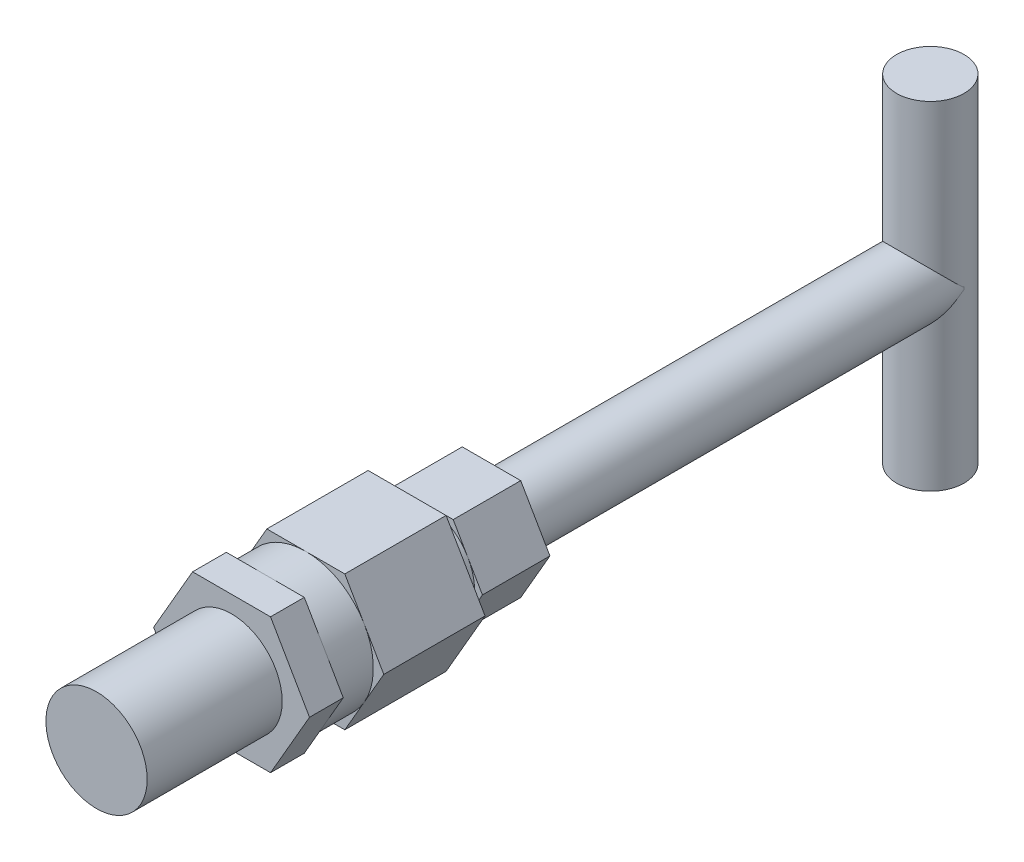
from build123d import *

# Parameters (mm, degrees)
BOSS_EXTRUDE1_DEPTH = 3
SKETCH2_R           = 4
BOSS_EXTRUDE2_DEPTH = 2.4
BOSS_EXTRUDE4_DEPTH = 2
SKETCH5_R           = 3
BOSS_EXTRUDE5_DEPTH = 8
BOSS_EXTRUDE6_START = 1
SKETCH3_R           = 3
BOSS_EXTRUDE6_DEPTH = 1
BOSS_EXTRUDE7_DEPTH = 4
SKETCH7_R           = 2
BOSS_EXTRUDE8_DEPTH = 26
SKETCH9_R           = 1.99809491
BOSS_EXTRUDE9_DEPTH = 10


with BuildPart() as part:
    # Sketch1 → Boss-Extrude1 (new, symmetric)
    with BuildSketch(Plane.XY):
        Polygon((2.309401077, 4), (-2.309401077, 4), (-4.618802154, 0), (-2.309401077, -4), (2.309401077, -4), (4.618802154, 0), align=None)
    extrude(amount=BOSS_EXTRUDE1_DEPTH, both=True)

    # Sketch2 → Boss-Extrude2 (add)
    with BuildSketch(Plane.XY.offset(3)):
        with Locations(Location((0, 0, 0), (0, 0, 150))):
            Circle(SKETCH2_R)
    extrude(amount=BOSS_EXTRUDE2_DEPTH)

    # Sketch4 → Boss-Extrude4 (add)
    with BuildSketch(Plane.XY.offset(5.4)):
        Polygon((2.309401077, 4), (-2.309401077, 4), (-4.618802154, 0), (-2.309401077, -4), (2.309401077, -4), (4.618802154, 0), align=None)
    extrude(amount=BOSS_EXTRUDE4_DEPTH)

    # Sketch5 → Boss-Extrude5 (add)
    with BuildSketch(Plane.XY.offset(7.4)):
        Circle(SKETCH5_R)
    extrude(amount=BOSS_EXTRUDE5_DEPTH)

    # Sketch3 → Boss-Extrude6 (add)
    with BuildSketch(Plane(origin=(0, 0, -3), x_dir=(-1, 0, 0), z_dir=(0, 0, -1)).offset(BOSS_EXTRUDE6_START)):
        with Locations(Location((0, 0, 0), (0, 0, 180))):
            Circle(SKETCH3_R)
    extrude(amount=-BOSS_EXTRUDE6_DEPTH)

    # Sketch6 → Boss-Extrude7 (add)
    with BuildSketch(Plane(origin=(0, 0, -4), x_dir=(-1, 0, 0), z_dir=(0, 0, -1))):
        Polygon((3.464101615, 0), (1.732050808, 3), (-1.732050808, 3), (-3.464101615, 0), (-1.732050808, -3), (1.732050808, -3), align=None)
    extrude(amount=BOSS_EXTRUDE7_DEPTH)

    # Sketch7 → Boss-Extrude8 (add)
    with BuildSketch(Plane(origin=(0, 0, -8), x_dir=(-1, 0, 0), z_dir=(0, 0, -1))):
        with Locations(Location((0, 0, 0), (0, 0, 180))):
            Circle(SKETCH7_R)
    extrude(amount=BOSS_EXTRUDE8_DEPTH)

    # Sketch9 → Boss-Extrude9 (add, symmetric)
    with BuildSketch(Plane(origin=(0, 0, 0), x_dir=(1, 0, 0), z_dir=(0, 1, 0))):
        with Locations(Location((0, 34, 0), (0, 0, 270))):
            Circle(SKETCH9_R)
    extrude(amount=BOSS_EXTRUDE9_DEPTH, both=True)


solid = part.part
